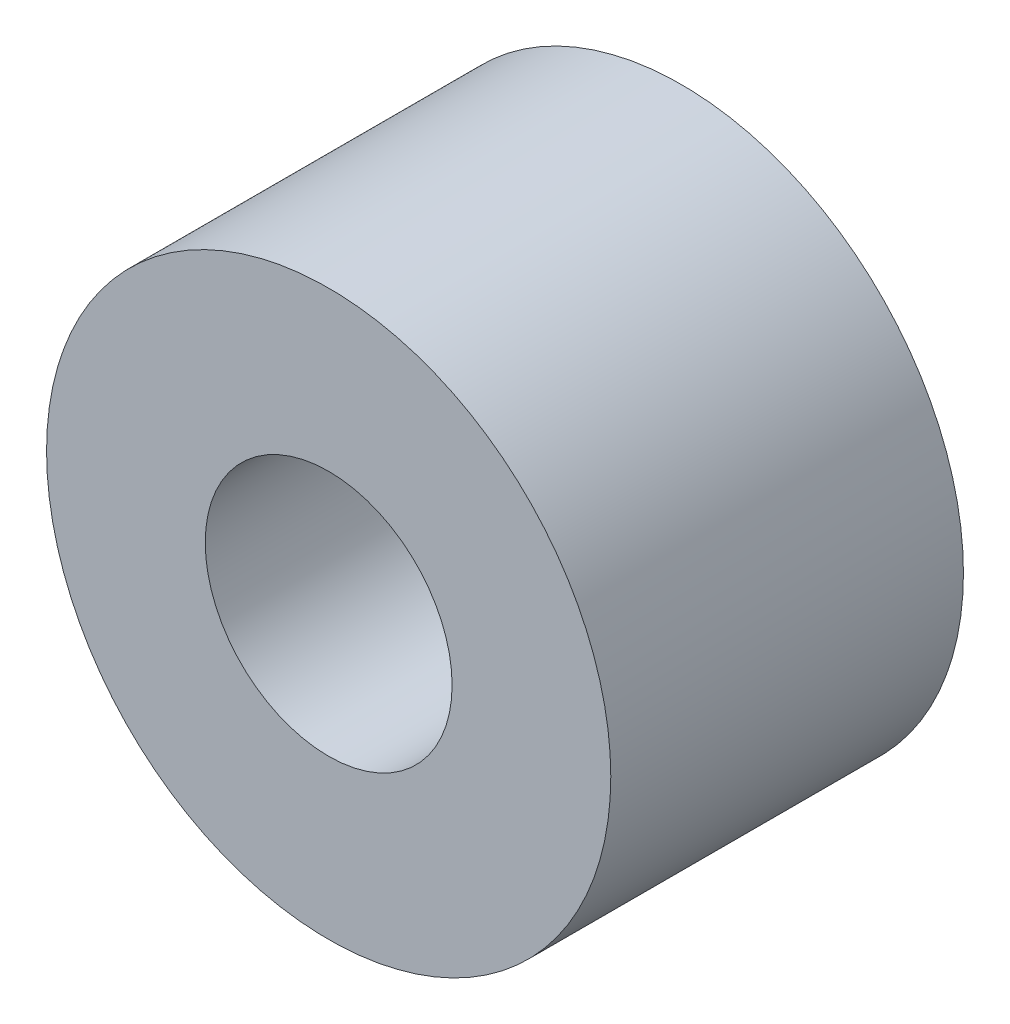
ISO-10303-21;
HEADER;
FILE_DESCRIPTION(('STEP AP214'),'2;1');
FILE_NAME('part.step','',(''),(''),'','','');
FILE_SCHEMA(('AUTOMOTIVE_DESIGN { 1 0 10303 214 1 1 1 1 }'));
ENDSEC;
DATA;
#1=APPLICATION_CONTEXT('core data for automotive mechanical design processes');
#2=APPLICATION_PROTOCOL_DEFINITION('international standard','automotive_design',2000,#1);
#3=PRODUCT_CONTEXT('',#1,'mechanical');
#4=PRODUCT('Part','Part','',(#3));
#5=PRODUCT_RELATED_PRODUCT_CATEGORY('part','',(#4));
#6=PRODUCT_DEFINITION_FORMATION('','',#4);
#7=PRODUCT_DEFINITION_CONTEXT('part definition',#1,'design');
#8=PRODUCT_DEFINITION('design','',#6,#7);
#9=PRODUCT_DEFINITION_SHAPE('','',#8);
#10=(LENGTH_UNIT() NAMED_UNIT(*) SI_UNIT(.MILLI.,.METRE.));
#11=(NAMED_UNIT(*) PLANE_ANGLE_UNIT() SI_UNIT($,.RADIAN.));
#12=(NAMED_UNIT(*) SI_UNIT($,.STERADIAN.) SOLID_ANGLE_UNIT());
#13=UNCERTAINTY_MEASURE_WITH_UNIT(LENGTH_MEASURE(1.E-05),#10,'distance_accuracy_value','');
#14=(GEOMETRIC_REPRESENTATION_CONTEXT(3) GLOBAL_UNCERTAINTY_ASSIGNED_CONTEXT((#13)) GLOBAL_UNIT_ASSIGNED_CONTEXT((#10,
#11,#12)) REPRESENTATION_CONTEXT('',''));
#15=CARTESIAN_POINT('',(0.,0.,0.));
#16=DIRECTION('',(0.,0.,1.));
#17=DIRECTION('',(1.,0.,0.));
#18=AXIS2_PLACEMENT_3D('',#15,#16,#17);
#19=CARTESIAN_POINT('',(0.,0.,0.));
#20=DIRECTION('',(0.,0.,-1.));
#21=DIRECTION('',(-1.,0.,0.));
#22=AXIS2_PLACEMENT_3D('',#19,#20,#21);
#23=PLANE('',#22);
#24=CARTESIAN_POINT('',(0.,0.,0.));
#25=DIRECTION('',(0.,0.,-1.));
#26=DIRECTION('',(-1.,0.,0.));
#27=AXIS2_PLACEMENT_3D('',#24,#25,#26);
#28=CIRCLE('',#27,1.75);
#29=CARTESIAN_POINT('',(-1.75,0.,0.));
#30=VERTEX_POINT('',#29);
#31=EDGE_CURVE('E42',#30,#30,#28,.T.);
#32=ORIENTED_EDGE('',*,*,#31,.T.);
#33=EDGE_LOOP('',(#32));
#34=FACE_BOUND('',#33,.T.);
#35=CARTESIAN_POINT('',(0.,0.,0.));
#36=DIRECTION('',(0.,0.,-1.));
#37=DIRECTION('',(-1.,0.,0.));
#38=AXIS2_PLACEMENT_3D('',#35,#36,#37);
#39=CIRCLE('',#38,4.);
#40=CARTESIAN_POINT('',(-4.,0.,0.));
#41=VERTEX_POINT('',#40);
#42=EDGE_CURVE('E10',#41,#41,#39,.T.);
#43=ORIENTED_EDGE('',*,*,#42,.F.);
#44=EDGE_LOOP('',(#43));
#45=FACE_BOUND('',#44,.T.);
#46=ADVANCED_FACE('F32',(#34,#45),#23,.F.);
#47=CARTESIAN_POINT('',(0.,0.,0.));
#48=DIRECTION('',(0.,0.,-1.));
#49=DIRECTION('',(-1.,0.,0.));
#50=AXIS2_PLACEMENT_3D('',#47,#48,#49);
#51=CYLINDRICAL_SURFACE('',#50,4.);
#52=CARTESIAN_POINT('',(0.,0.,-5.));
#53=DIRECTION('',(0.,0.,-1.));
#54=DIRECTION('',(-1.,0.,0.));
#55=AXIS2_PLACEMENT_3D('',#52,#53,#54);
#56=CIRCLE('',#55,4.);
#57=CARTESIAN_POINT('',(-4.,0.,-5.));
#58=VERTEX_POINT('',#57);
#59=EDGE_CURVE('E38',#58,#58,#56,.T.);
#60=ORIENTED_EDGE('',*,*,#59,.F.);
#61=EDGE_LOOP('',(#60));
#62=FACE_BOUND('',#61,.T.);
#63=ORIENTED_EDGE('',*,*,#42,.T.);
#64=EDGE_LOOP('',(#63));
#65=FACE_BOUND('',#64,.T.);
#66=ADVANCED_FACE('F57',(#62,#65),#51,.T.);
#67=CARTESIAN_POINT('',(0.,0.,-5.));
#68=DIRECTION('',(0.,0.,1.));
#69=DIRECTION('',(1.,0.,0.));
#70=AXIS2_PLACEMENT_3D('',#67,#68,#69);
#71=PLANE('',#70);
#72=CARTESIAN_POINT('',(0.,0.,-5.));
#73=DIRECTION('',(0.,0.,-1.));
#74=DIRECTION('',(-1.,0.,0.));
#75=AXIS2_PLACEMENT_3D('',#72,#73,#74);
#76=CIRCLE('',#75,1.75);
#77=CARTESIAN_POINT('',(-1.75,0.,-5.));
#78=VERTEX_POINT('',#77);
#79=EDGE_CURVE('E46',#78,#78,#76,.T.);
#80=ORIENTED_EDGE('',*,*,#79,.F.);
#81=EDGE_LOOP('',(#80));
#82=FACE_BOUND('',#81,.T.);
#83=ORIENTED_EDGE('',*,*,#59,.T.);
#84=EDGE_LOOP('',(#83));
#85=FACE_BOUND('',#84,.T.);
#86=ADVANCED_FACE('F55',(#82,#85),#71,.F.);
#87=CARTESIAN_POINT('',(0.,0.,0.));
#88=DIRECTION('',(0.,0.,-1.));
#89=DIRECTION('',(-1.,0.,0.));
#90=AXIS2_PLACEMENT_3D('',#87,#88,#89);
#91=CYLINDRICAL_SURFACE('',#90,1.75);
#92=ORIENTED_EDGE('',*,*,#79,.T.);
#93=EDGE_LOOP('',(#92));
#94=FACE_BOUND('',#93,.T.);
#95=ORIENTED_EDGE('',*,*,#31,.F.);
#96=EDGE_LOOP('',(#95));
#97=FACE_BOUND('',#96,.T.);
#98=ADVANCED_FACE('F52',(#94,#97),#91,.F.);
#99=CLOSED_SHELL('',(#46,#66,#86,#98));
#100=MANIFOLD_SOLID_BREP('B2',#99);
#101=ADVANCED_BREP_SHAPE_REPRESENTATION('',(#18,#100),#14);
#102=SHAPE_DEFINITION_REPRESENTATION(#9,#101);
ENDSEC;
END-ISO-10303-21;
